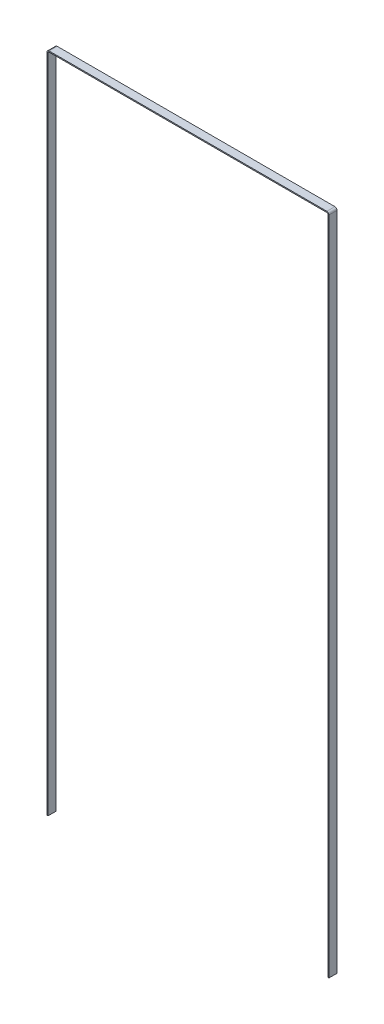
ISO-10303-21;
HEADER;
FILE_DESCRIPTION(('STEP AP214'),'2;1');
FILE_NAME('part.step','',(''),(''),'','','');
FILE_SCHEMA(('AUTOMOTIVE_DESIGN { 1 0 10303 214 1 1 1 1 }'));
ENDSEC;
DATA;
#1=APPLICATION_CONTEXT('core data for automotive mechanical design processes');
#2=APPLICATION_PROTOCOL_DEFINITION('international standard','automotive_design',2000,#1);
#3=PRODUCT_CONTEXT('',#1,'mechanical');
#4=PRODUCT('Part','Part','',(#3));
#5=PRODUCT_RELATED_PRODUCT_CATEGORY('part','',(#4));
#6=PRODUCT_DEFINITION_FORMATION('','',#4);
#7=PRODUCT_DEFINITION_CONTEXT('part definition',#1,'design');
#8=PRODUCT_DEFINITION('design','',#6,#7);
#9=PRODUCT_DEFINITION_SHAPE('','',#8);
#10=(LENGTH_UNIT() NAMED_UNIT(*) SI_UNIT(.MILLI.,.METRE.));
#11=(NAMED_UNIT(*) PLANE_ANGLE_UNIT() SI_UNIT($,.RADIAN.));
#12=(NAMED_UNIT(*) SI_UNIT($,.STERADIAN.) SOLID_ANGLE_UNIT());
#13=UNCERTAINTY_MEASURE_WITH_UNIT(LENGTH_MEASURE(1.E-05),#10,'distance_accuracy_value','');
#14=(GEOMETRIC_REPRESENTATION_CONTEXT(3) GLOBAL_UNCERTAINTY_ASSIGNED_CONTEXT((#13)) GLOBAL_UNIT_ASSIGNED_CONTEXT((#10,
#11,#12)) REPRESENTATION_CONTEXT('',''));
#15=CARTESIAN_POINT('',(0.,0.,0.));
#16=DIRECTION('',(0.,0.,1.));
#17=DIRECTION('',(1.,0.,0.));
#18=AXIS2_PLACEMENT_3D('',#15,#16,#17);
#19=CARTESIAN_POINT('',(0.,0.,15.));
#20=DIRECTION('',(0.,1.,0.));
#21=DIRECTION('',(0.,0.,1.));
#22=AXIS2_PLACEMENT_3D('',#19,#20,#21);
#23=PLANE('',#22);
#24=DIRECTION('',(1.,0.,0.));
#25=VECTOR('',#24,1.);
#26=CARTESIAN_POINT('',(0.,0.,0.));
#27=LINE('',#26,#25);
#28=CARTESIAN_POINT('',(0.,0.,0.));
#29=VERTEX_POINT('',#28);
#30=CARTESIAN_POINT('',(2.,0.,0.));
#31=VERTEX_POINT('',#30);
#32=EDGE_CURVE('E153',#29,#31,#27,.T.);
#33=ORIENTED_EDGE('',*,*,#32,.T.);
#34=DIRECTION('',(0.,0.,-1.));
#35=VECTOR('',#34,1.);
#36=CARTESIAN_POINT('',(2.,0.,15.));
#37=LINE('',#36,#35);
#38=CARTESIAN_POINT('',(2.,0.,15.));
#39=VERTEX_POINT('',#38);
#40=EDGE_CURVE('E11',#39,#31,#37,.T.);
#41=ORIENTED_EDGE('',*,*,#40,.F.);
#42=DIRECTION('',(1.,0.,0.));
#43=VECTOR('',#42,1.);
#44=CARTESIAN_POINT('',(0.,0.,15.));
#45=LINE('',#44,#43);
#46=CARTESIAN_POINT('',(0.,0.,15.));
#47=VERTEX_POINT('',#46);
#48=EDGE_CURVE('E175',#47,#39,#45,.T.);
#49=ORIENTED_EDGE('',*,*,#48,.F.);
#50=DIRECTION('',(0.,0.,-1.));
#51=VECTOR('',#50,1.);
#52=CARTESIAN_POINT('',(0.,0.,15.));
#53=LINE('',#52,#51);
#54=EDGE_CURVE('E149',#47,#29,#53,.T.);
#55=ORIENTED_EDGE('',*,*,#54,.T.);
#56=EDGE_LOOP('',(#33,#41,#49,#55));
#57=FACE_BOUND('',#56,.T.);
#58=ADVANCED_FACE('F33',(#57),#23,.F.);
#59=CARTESIAN_POINT('',(1.99999999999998,1228.,15.));
#60=DIRECTION('',(-1.,0.,0.));
#61=DIRECTION('',(0.,-1.,0.));
#62=AXIS2_PLACEMENT_3D('',#59,#60,#61);
#63=PLANE('',#62);
#64=DIRECTION('',(0.,1.,0.));
#65=VECTOR('',#64,1.);
#66=CARTESIAN_POINT('',(1.99999999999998,1228.,0.));
#67=LINE('',#66,#65);
#68=CARTESIAN_POINT('',(1.99999999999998,1228.,0.));
#69=VERTEX_POINT('',#68);
#70=EDGE_CURVE('E156',#31,#69,#67,.T.);
#71=ORIENTED_EDGE('',*,*,#70,.T.);
#72=DIRECTION('',(0.,0.,-1.));
#73=VECTOR('',#72,1.);
#74=CARTESIAN_POINT('',(1.99999999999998,1228.,15.));
#75=LINE('',#74,#73);
#76=CARTESIAN_POINT('',(1.99999999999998,1228.,15.));
#77=VERTEX_POINT('',#76);
#78=EDGE_CURVE('E41',#77,#69,#75,.T.);
#79=ORIENTED_EDGE('',*,*,#78,.F.);
#80=DIRECTION('',(0.,1.,0.));
#81=VECTOR('',#80,1.);
#82=CARTESIAN_POINT('',(1.99999999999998,1228.,15.));
#83=LINE('',#82,#81);
#84=EDGE_CURVE('E104',#39,#77,#83,.T.);
#85=ORIENTED_EDGE('',*,*,#84,.F.);
#86=ORIENTED_EDGE('',*,*,#40,.T.);
#87=EDGE_LOOP('',(#71,#79,#85,#86));
#88=FACE_BOUND('',#87,.T.);
#89=ADVANCED_FACE('F253',(#88),#63,.F.);
#90=CARTESIAN_POINT('',(-2.00000000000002,1228.,15.));
#91=DIRECTION('',(0.,0.,-1.));
#92=DIRECTION('',(-1.,0.,0.));
#93=AXIS2_PLACEMENT_3D('',#90,#91,#92);
#94=CYLINDRICAL_SURFACE('',#93,4.);
#95=CARTESIAN_POINT('',(-2.00000000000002,1228.,0.));
#96=DIRECTION('',(0.,0.,1.));
#97=DIRECTION('',(-1.,0.,0.));
#98=AXIS2_PLACEMENT_3D('',#95,#96,#97);
#99=CIRCLE('',#98,4.);
#100=CARTESIAN_POINT('',(-2.,1232.,0.));
#101=VERTEX_POINT('',#100);
#102=EDGE_CURVE('E158',#69,#101,#99,.T.);
#103=ORIENTED_EDGE('',*,*,#102,.T.);
#104=DIRECTION('',(0.,0.,-1.));
#105=VECTOR('',#104,1.);
#106=CARTESIAN_POINT('',(-2.,1232.,15.));
#107=LINE('',#106,#105);
#108=CARTESIAN_POINT('',(-2.,1232.,15.));
#109=VERTEX_POINT('',#108);
#110=EDGE_CURVE('E194',#109,#101,#107,.T.);
#111=ORIENTED_EDGE('',*,*,#110,.F.);
#112=CARTESIAN_POINT('',(-2.00000000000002,1228.,15.));
#113=DIRECTION('',(0.,0.,1.));
#114=DIRECTION('',(-1.,0.,0.));
#115=AXIS2_PLACEMENT_3D('',#112,#113,#114);
#116=CIRCLE('',#115,4.);
#117=EDGE_CURVE('E202',#77,#109,#116,.T.);
#118=ORIENTED_EDGE('',*,*,#117,.F.);
#119=ORIENTED_EDGE('',*,*,#78,.T.);
#120=EDGE_LOOP('',(#103,#111,#118,#119));
#121=FACE_BOUND('',#120,.T.);
#122=ADVANCED_FACE('F200',(#121),#94,.T.);
#123=CARTESIAN_POINT('',(-518.,1232.,15.));
#124=DIRECTION('',(0.,-1.,0.));
#125=DIRECTION('',(0.,0.,-1.));
#126=AXIS2_PLACEMENT_3D('',#123,#124,#125);
#127=PLANE('',#126);
#128=DIRECTION('',(-1.,0.,0.));
#129=VECTOR('',#128,1.);
#130=CARTESIAN_POINT('',(-518.,1232.,0.));
#131=LINE('',#130,#129);
#132=CARTESIAN_POINT('',(-518.,1232.,0.));
#133=VERTEX_POINT('',#132);
#134=EDGE_CURVE('E160',#101,#133,#131,.T.);
#135=ORIENTED_EDGE('',*,*,#134,.T.);
#136=DIRECTION('',(0.,0.,-1.));
#137=VECTOR('',#136,1.);
#138=CARTESIAN_POINT('',(-518.,1232.,15.));
#139=LINE('',#138,#137);
#140=CARTESIAN_POINT('',(-518.,1232.,15.));
#141=VERTEX_POINT('',#140);
#142=EDGE_CURVE('E191',#141,#133,#139,.T.);
#143=ORIENTED_EDGE('',*,*,#142,.F.);
#144=DIRECTION('',(-1.,0.,0.));
#145=VECTOR('',#144,1.);
#146=CARTESIAN_POINT('',(-518.,1232.,15.));
#147=LINE('',#146,#145);
#148=EDGE_CURVE('E220',#109,#141,#147,.T.);
#149=ORIENTED_EDGE('',*,*,#148,.F.);
#150=ORIENTED_EDGE('',*,*,#110,.T.);
#151=EDGE_LOOP('',(#135,#143,#149,#150));
#152=FACE_BOUND('',#151,.T.);
#153=ADVANCED_FACE('F211',(#152),#127,.F.);
#154=CARTESIAN_POINT('',(-518.,1228.,15.));
#155=DIRECTION('',(0.,0.,-1.));
#156=DIRECTION('',(-1.,0.,0.));
#157=AXIS2_PLACEMENT_3D('',#154,#155,#156);
#158=CYLINDRICAL_SURFACE('',#157,4.);
#159=CARTESIAN_POINT('',(-518.,1228.,0.));
#160=DIRECTION('',(0.,0.,1.));
#161=DIRECTION('',(1.,0.,0.));
#162=AXIS2_PLACEMENT_3D('',#159,#160,#161);
#163=CIRCLE('',#162,4.);
#164=CARTESIAN_POINT('',(-522.,1228.,0.));
#165=VERTEX_POINT('',#164);
#166=EDGE_CURVE('E162',#133,#165,#163,.T.);
#167=ORIENTED_EDGE('',*,*,#166,.T.);
#168=DIRECTION('',(0.,0.,-1.));
#169=VECTOR('',#168,1.);
#170=CARTESIAN_POINT('',(-522.,1228.,15.));
#171=LINE('',#170,#169);
#172=CARTESIAN_POINT('',(-522.,1228.,15.));
#173=VERTEX_POINT('',#172);
#174=EDGE_CURVE('E188',#173,#165,#171,.T.);
#175=ORIENTED_EDGE('',*,*,#174,.F.);
#176=CARTESIAN_POINT('',(-518.,1228.,15.));
#177=DIRECTION('',(0.,0.,1.));
#178=DIRECTION('',(1.,0.,0.));
#179=AXIS2_PLACEMENT_3D('',#176,#177,#178);
#180=CIRCLE('',#179,4.);
#181=EDGE_CURVE('E217',#141,#173,#180,.T.);
#182=ORIENTED_EDGE('',*,*,#181,.F.);
#183=ORIENTED_EDGE('',*,*,#142,.T.);
#184=EDGE_LOOP('',(#167,#175,#182,#183));
#185=FACE_BOUND('',#184,.T.);
#186=ADVANCED_FACE('F215',(#185),#158,.T.);
#187=CARTESIAN_POINT('',(-522.,1228.,15.));
#188=DIRECTION('',(1.,0.,0.));
#189=DIRECTION('',(0.,1.,0.));
#190=AXIS2_PLACEMENT_3D('',#187,#188,#189);
#191=PLANE('',#190);
#192=DIRECTION('',(0.,-1.,0.));
#193=VECTOR('',#192,1.);
#194=CARTESIAN_POINT('',(-522.,1228.,0.));
#195=LINE('',#194,#193);
#196=CARTESIAN_POINT('',(-522.,0.,0.));
#197=VERTEX_POINT('',#196);
#198=EDGE_CURVE('E164',#165,#197,#195,.T.);
#199=ORIENTED_EDGE('',*,*,#198,.T.);
#200=DIRECTION('',(0.,0.,-1.));
#201=VECTOR('',#200,1.);
#202=CARTESIAN_POINT('',(-522.,0.,15.));
#203=LINE('',#202,#201);
#204=CARTESIAN_POINT('',(-522.,0.,15.));
#205=VERTEX_POINT('',#204);
#206=EDGE_CURVE('E185',#205,#197,#203,.T.);
#207=ORIENTED_EDGE('',*,*,#206,.F.);
#208=DIRECTION('',(0.,-1.,0.));
#209=VECTOR('',#208,1.);
#210=CARTESIAN_POINT('',(-522.,1228.,15.));
#211=LINE('',#210,#209);
#212=EDGE_CURVE('E219',#173,#205,#211,.T.);
#213=ORIENTED_EDGE('',*,*,#212,.F.);
#214=ORIENTED_EDGE('',*,*,#174,.T.);
#215=EDGE_LOOP('',(#199,#207,#213,#214));
#216=FACE_BOUND('',#215,.T.);
#217=ADVANCED_FACE('F266',(#216),#191,.F.);
#218=CARTESIAN_POINT('',(-520.,0.,15.));
#219=DIRECTION('',(0.,1.,0.));
#220=DIRECTION('',(0.,0.,1.));
#221=AXIS2_PLACEMENT_3D('',#218,#219,#220);
#222=PLANE('',#221);
#223=DIRECTION('',(1.,0.,0.));
#224=VECTOR('',#223,1.);
#225=CARTESIAN_POINT('',(-520.,0.,0.));
#226=LINE('',#225,#224);
#227=CARTESIAN_POINT('',(-520.,0.,0.));
#228=VERTEX_POINT('',#227);
#229=EDGE_CURVE('E166',#197,#228,#226,.T.);
#230=ORIENTED_EDGE('',*,*,#229,.T.);
#231=DIRECTION('',(0.,0.,-1.));
#232=VECTOR('',#231,1.);
#233=CARTESIAN_POINT('',(-520.,0.,15.));
#234=LINE('',#233,#232);
#235=CARTESIAN_POINT('',(-520.,0.,15.));
#236=VERTEX_POINT('',#235);
#237=EDGE_CURVE('E182',#236,#228,#234,.T.);
#238=ORIENTED_EDGE('',*,*,#237,.F.);
#239=DIRECTION('',(1.,0.,0.));
#240=VECTOR('',#239,1.);
#241=CARTESIAN_POINT('',(-520.,0.,15.));
#242=LINE('',#241,#240);
#243=EDGE_CURVE('E222',#205,#236,#242,.T.);
#244=ORIENTED_EDGE('',*,*,#243,.F.);
#245=ORIENTED_EDGE('',*,*,#206,.T.);
#246=EDGE_LOOP('',(#230,#238,#244,#245));
#247=FACE_BOUND('',#246,.T.);
#248=ADVANCED_FACE('F269',(#247),#222,.F.);
#249=CARTESIAN_POINT('',(-520.,1228.,15.));
#250=DIRECTION('',(-1.,0.,0.));
#251=DIRECTION('',(0.,-1.,0.));
#252=AXIS2_PLACEMENT_3D('',#249,#250,#251);
#253=PLANE('',#252);
#254=DIRECTION('',(0.,1.,0.));
#255=VECTOR('',#254,1.);
#256=CARTESIAN_POINT('',(-520.,1228.,0.));
#257=LINE('',#256,#255);
#258=CARTESIAN_POINT('',(-520.,1228.,0.));
#259=VERTEX_POINT('',#258);
#260=EDGE_CURVE('E168',#228,#259,#257,.T.);
#261=ORIENTED_EDGE('',*,*,#260,.T.);
#262=DIRECTION('',(0.,0.,-1.));
#263=VECTOR('',#262,1.);
#264=CARTESIAN_POINT('',(-520.,1228.,15.));
#265=LINE('',#264,#263);
#266=CARTESIAN_POINT('',(-520.,1228.,15.));
#267=VERTEX_POINT('',#266);
#268=EDGE_CURVE('E179',#267,#259,#265,.T.);
#269=ORIENTED_EDGE('',*,*,#268,.F.);
#270=DIRECTION('',(0.,1.,0.));
#271=VECTOR('',#270,1.);
#272=CARTESIAN_POINT('',(-520.,1228.,15.));
#273=LINE('',#272,#271);
#274=EDGE_CURVE('E228',#236,#267,#273,.T.);
#275=ORIENTED_EDGE('',*,*,#274,.F.);
#276=ORIENTED_EDGE('',*,*,#237,.T.);
#277=EDGE_LOOP('',(#261,#269,#275,#276));
#278=FACE_BOUND('',#277,.T.);
#279=ADVANCED_FACE('F234',(#278),#253,.F.);
#280=CARTESIAN_POINT('',(-518.,1228.,15.));
#281=DIRECTION('',(0.,0.,-1.));
#282=DIRECTION('',(-1.,0.,0.));
#283=AXIS2_PLACEMENT_3D('',#280,#281,#282);
#284=CYLINDRICAL_SURFACE('',#283,2.);
#285=CARTESIAN_POINT('',(-518.,1228.,0.));
#286=DIRECTION('',(0.,0.,-1.));
#287=DIRECTION('',(1.,0.,0.));
#288=AXIS2_PLACEMENT_3D('',#285,#286,#287);
#289=CIRCLE('',#288,2.);
#290=CARTESIAN_POINT('',(-518.,1230.,0.));
#291=VERTEX_POINT('',#290);
#292=EDGE_CURVE('E170',#259,#291,#289,.T.);
#293=ORIENTED_EDGE('',*,*,#292,.T.);
#294=DIRECTION('',(0.,0.,-1.));
#295=VECTOR('',#294,1.);
#296=CARTESIAN_POINT('',(-518.,1230.,15.));
#297=LINE('',#296,#295);
#298=CARTESIAN_POINT('',(-518.,1230.,15.));
#299=VERTEX_POINT('',#298);
#300=EDGE_CURVE('E144',#299,#291,#297,.T.);
#301=ORIENTED_EDGE('',*,*,#300,.F.);
#302=CARTESIAN_POINT('',(-518.,1228.,15.));
#303=DIRECTION('',(0.,0.,-1.));
#304=DIRECTION('',(1.,0.,0.));
#305=AXIS2_PLACEMENT_3D('',#302,#303,#304);
#306=CIRCLE('',#305,2.);
#307=EDGE_CURVE('E135',#267,#299,#306,.T.);
#308=ORIENTED_EDGE('',*,*,#307,.F.);
#309=ORIENTED_EDGE('',*,*,#268,.T.);
#310=EDGE_LOOP('',(#293,#301,#308,#309));
#311=FACE_BOUND('',#310,.T.);
#312=ADVANCED_FACE('F238',(#311),#284,.F.);
#313=CARTESIAN_POINT('',(-518.,1230.,15.));
#314=DIRECTION('',(0.,1.,0.));
#315=DIRECTION('',(0.,0.,1.));
#316=AXIS2_PLACEMENT_3D('',#313,#314,#315);
#317=PLANE('',#316);
#318=DIRECTION('',(1.,0.,0.));
#319=VECTOR('',#318,1.);
#320=CARTESIAN_POINT('',(-518.,1230.,0.));
#321=LINE('',#320,#319);
#322=CARTESIAN_POINT('',(-2.00000000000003,1230.,0.));
#323=VERTEX_POINT('',#322);
#324=EDGE_CURVE('E143',#291,#323,#321,.T.);
#325=ORIENTED_EDGE('',*,*,#324,.T.);
#326=DIRECTION('',(0.,0.,-1.));
#327=VECTOR('',#326,1.);
#328=CARTESIAN_POINT('',(-2.00000000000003,1230.,15.));
#329=LINE('',#328,#327);
#330=CARTESIAN_POINT('',(-2.00000000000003,1230.,15.));
#331=VERTEX_POINT('',#330);
#332=EDGE_CURVE('E140',#331,#323,#329,.T.);
#333=ORIENTED_EDGE('',*,*,#332,.F.);
#334=DIRECTION('',(1.,0.,0.));
#335=VECTOR('',#334,1.);
#336=CARTESIAN_POINT('',(-518.,1230.,15.));
#337=LINE('',#336,#335);
#338=EDGE_CURVE('E129',#299,#331,#337,.T.);
#339=ORIENTED_EDGE('',*,*,#338,.F.);
#340=ORIENTED_EDGE('',*,*,#300,.T.);
#341=EDGE_LOOP('',(#325,#333,#339,#340));
#342=FACE_BOUND('',#341,.T.);
#343=ADVANCED_FACE('F141',(#342),#317,.F.);
#344=CARTESIAN_POINT('',(-2.00000000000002,1228.,15.));
#345=DIRECTION('',(0.,0.,-1.));
#346=DIRECTION('',(-1.,0.,0.));
#347=AXIS2_PLACEMENT_3D('',#344,#345,#346);
#348=CYLINDRICAL_SURFACE('',#347,2.);
#349=CARTESIAN_POINT('',(-2.00000000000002,1228.,0.));
#350=DIRECTION('',(0.,0.,-1.));
#351=DIRECTION('',(-1.,0.,0.));
#352=AXIS2_PLACEMENT_3D('',#349,#350,#351);
#353=CIRCLE('',#352,2.);
#354=CARTESIAN_POINT('',(0.,1228.,0.));
#355=VERTEX_POINT('',#354);
#356=EDGE_CURVE('E90',#323,#355,#353,.T.);
#357=ORIENTED_EDGE('',*,*,#356,.T.);
#358=DIRECTION('',(0.,0.,-1.));
#359=VECTOR('',#358,1.);
#360=CARTESIAN_POINT('',(0.,1228.,15.));
#361=LINE('',#360,#359);
#362=CARTESIAN_POINT('',(0.,1228.,15.));
#363=VERTEX_POINT('',#362);
#364=EDGE_CURVE('E145',#363,#355,#361,.T.);
#365=ORIENTED_EDGE('',*,*,#364,.F.);
#366=CARTESIAN_POINT('',(-2.00000000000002,1228.,15.));
#367=DIRECTION('',(0.,0.,-1.));
#368=DIRECTION('',(-1.,0.,0.));
#369=AXIS2_PLACEMENT_3D('',#366,#367,#368);
#370=CIRCLE('',#369,2.);
#371=EDGE_CURVE('E133',#331,#363,#370,.T.);
#372=ORIENTED_EDGE('',*,*,#371,.F.);
#373=ORIENTED_EDGE('',*,*,#332,.T.);
#374=EDGE_LOOP('',(#357,#365,#372,#373));
#375=FACE_BOUND('',#374,.T.);
#376=ADVANCED_FACE('F147',(#375),#348,.F.);
#377=CARTESIAN_POINT('',(0.,1228.,15.));
#378=DIRECTION('',(1.,0.,0.));
#379=DIRECTION('',(0.,1.,0.));
#380=AXIS2_PLACEMENT_3D('',#377,#378,#379);
#381=PLANE('',#380);
#382=DIRECTION('',(0.,-1.,0.));
#383=VECTOR('',#382,1.);
#384=CARTESIAN_POINT('',(0.,1228.,0.));
#385=LINE('',#384,#383);
#386=EDGE_CURVE('E96',#355,#29,#385,.T.);
#387=ORIENTED_EDGE('',*,*,#386,.T.);
#388=ORIENTED_EDGE('',*,*,#54,.F.);
#389=DIRECTION('',(0.,-1.,0.));
#390=VECTOR('',#389,1.);
#391=CARTESIAN_POINT('',(0.,1228.,15.));
#392=LINE('',#391,#390);
#393=EDGE_CURVE('E49',#363,#47,#392,.T.);
#394=ORIENTED_EDGE('',*,*,#393,.F.);
#395=ORIENTED_EDGE('',*,*,#364,.T.);
#396=EDGE_LOOP('',(#387,#388,#394,#395));
#397=FACE_BOUND('',#396,.T.);
#398=ADVANCED_FACE('F242',(#397),#381,.F.);
#399=CARTESIAN_POINT('',(-2.00000000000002,1228.,15.));
#400=DIRECTION('',(0.,0.,-1.));
#401=DIRECTION('',(-1.,0.,0.));
#402=AXIS2_PLACEMENT_3D('',#399,#400,#401);
#403=PLANE('',#402);
#404=ORIENTED_EDGE('',*,*,#48,.T.);
#405=ORIENTED_EDGE('',*,*,#84,.T.);
#406=ORIENTED_EDGE('',*,*,#117,.T.);
#407=ORIENTED_EDGE('',*,*,#148,.T.);
#408=ORIENTED_EDGE('',*,*,#181,.T.);
#409=ORIENTED_EDGE('',*,*,#212,.T.);
#410=ORIENTED_EDGE('',*,*,#243,.T.);
#411=ORIENTED_EDGE('',*,*,#274,.T.);
#412=ORIENTED_EDGE('',*,*,#307,.T.);
#413=ORIENTED_EDGE('',*,*,#338,.T.);
#414=ORIENTED_EDGE('',*,*,#371,.T.);
#415=ORIENTED_EDGE('',*,*,#393,.T.);
#416=EDGE_LOOP('',(#404,#405,#406,#407,#408,#409,#410,#411,#412,#413,#414,#415));
#417=FACE_BOUND('',#416,.T.);
#418=ADVANCED_FACE('F131',(#417),#403,.F.);
#419=CARTESIAN_POINT('',(-2.00000000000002,1228.,0.));
#420=DIRECTION('',(0.,0.,-1.));
#421=DIRECTION('',(-1.,0.,0.));
#422=AXIS2_PLACEMENT_3D('',#419,#420,#421);
#423=PLANE('',#422);
#424=ORIENTED_EDGE('',*,*,#32,.F.);
#425=ORIENTED_EDGE('',*,*,#386,.F.);
#426=ORIENTED_EDGE('',*,*,#356,.F.);
#427=ORIENTED_EDGE('',*,*,#324,.F.);
#428=ORIENTED_EDGE('',*,*,#292,.F.);
#429=ORIENTED_EDGE('',*,*,#260,.F.);
#430=ORIENTED_EDGE('',*,*,#229,.F.);
#431=ORIENTED_EDGE('',*,*,#198,.F.);
#432=ORIENTED_EDGE('',*,*,#166,.F.);
#433=ORIENTED_EDGE('',*,*,#134,.F.);
#434=ORIENTED_EDGE('',*,*,#102,.F.);
#435=ORIENTED_EDGE('',*,*,#70,.F.);
#436=EDGE_LOOP('',(#424,#425,#426,#427,#428,#429,#430,#431,#432,#433,#434,#435));
#437=FACE_BOUND('',#436,.T.);
#438=ADVANCED_FACE('F206',(#437),#423,.T.);
#439=CLOSED_SHELL('',(#58,#89,#122,#153,#186,#217,#248,#279,#312,#343,#376,#398,#418,#438));
#440=MANIFOLD_SOLID_BREP('B2',#439);
#441=ADVANCED_BREP_SHAPE_REPRESENTATION('',(#18,#440),#14);
#442=SHAPE_DEFINITION_REPRESENTATION(#9,#441);
ENDSEC;
END-ISO-10303-21;
